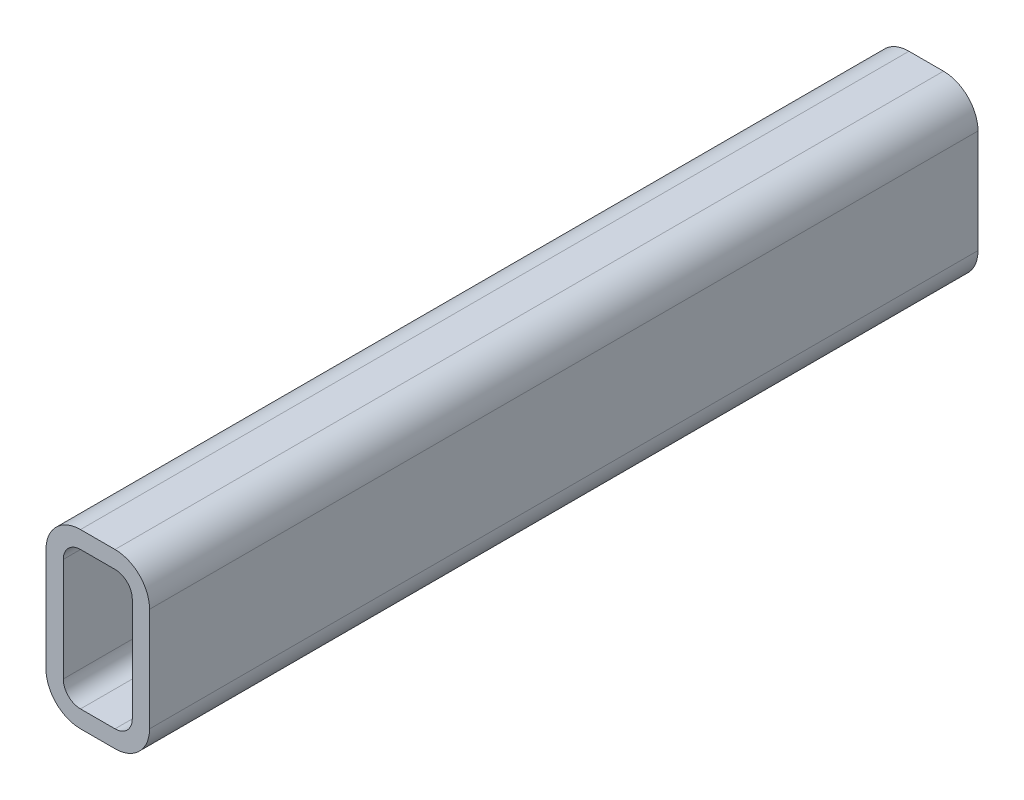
from build123d import *

# Parameters (mm, degrees)
BOSS_EXTRUDE1_DEPTH = 304.8


with BuildPart() as part:
    # Sketch1 → Boss-Extrude1 (new body)
    with BuildSketch(Plane.XY):
        with BuildLine():
            Line((12.7, 63.5), (25.4, 63.5))
            ThreePointArc((25.4, 63.5), (34.380256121, 59.780256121), (38.1, 50.8))
            Line((38.1, 50.8), (38.1, 12.7))
            ThreePointArc((38.1, 12.7), (34.380256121, 3.719743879), (25.4, 0))
            Line((25.4, 0), (12.7, 0))
            ThreePointArc((12.7, 0), (3.719743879, 3.719743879), (0, 12.7))
            Line((0, 12.7), (0, 50.8))
            ThreePointArc((0, 50.8), (3.719743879, 59.780256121), (12.7, 63.5))
        make_face()
        with BuildLine():
            Line((12.7, 57.15), (25.4, 57.15))
            ThreePointArc((25.4, 57.15), (29.890128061, 55.290128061), (31.75, 50.8))
            Line((31.75, 50.8), (31.75, 12.7))
            ThreePointArc((31.75, 12.7), (29.890128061, 8.209871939), (25.4, 6.35))
            Line((25.4, 6.35), (12.7, 6.35))
            ThreePointArc((12.7, 6.35), (8.209871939, 8.209871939), (6.35, 12.7))
            Line((6.35, 12.7), (6.35, 50.8))
            ThreePointArc((6.35, 50.8), (8.209871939, 55.290128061), (12.7, 57.15))
        make_face(mode=Mode.SUBTRACT)
    extrude(amount=BOSS_EXTRUDE1_DEPTH)


solid = part.part
